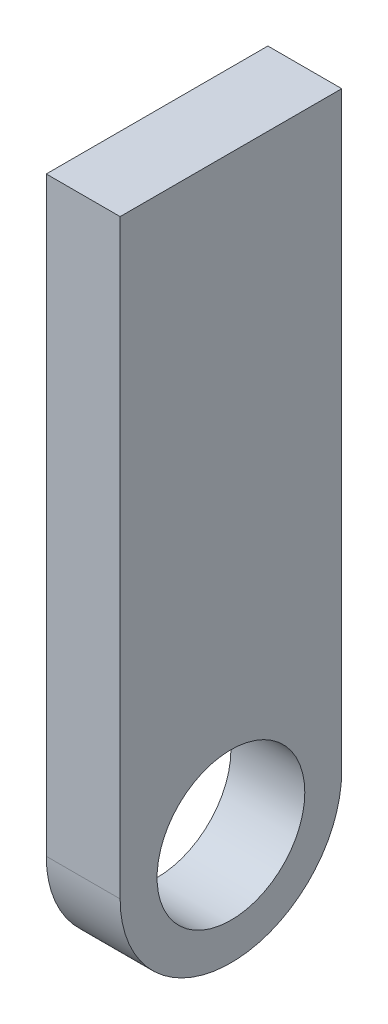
ISO-10303-21;
HEADER;
FILE_DESCRIPTION(('STEP AP214'),'2;1');
FILE_NAME('part.step','',(''),(''),'','','');
FILE_SCHEMA(('AUTOMOTIVE_DESIGN { 1 0 10303 214 1 1 1 1 }'));
ENDSEC;
DATA;
#1=APPLICATION_CONTEXT('core data for automotive mechanical design processes');
#2=APPLICATION_PROTOCOL_DEFINITION('international standard','automotive_design',2000,#1);
#3=PRODUCT_CONTEXT('',#1,'mechanical');
#4=PRODUCT('Part','Part','',(#3));
#5=PRODUCT_RELATED_PRODUCT_CATEGORY('part','',(#4));
#6=PRODUCT_DEFINITION_FORMATION('','',#4);
#7=PRODUCT_DEFINITION_CONTEXT('part definition',#1,'design');
#8=PRODUCT_DEFINITION('design','',#6,#7);
#9=PRODUCT_DEFINITION_SHAPE('','',#8);
#10=(LENGTH_UNIT() NAMED_UNIT(*) SI_UNIT(.MILLI.,.METRE.));
#11=(NAMED_UNIT(*) PLANE_ANGLE_UNIT() SI_UNIT($,.RADIAN.));
#12=(NAMED_UNIT(*) SI_UNIT($,.STERADIAN.) SOLID_ANGLE_UNIT());
#13=UNCERTAINTY_MEASURE_WITH_UNIT(LENGTH_MEASURE(1.E-05),#10,'distance_accuracy_value','');
#14=(GEOMETRIC_REPRESENTATION_CONTEXT(3) GLOBAL_UNCERTAINTY_ASSIGNED_CONTEXT((#13)) GLOBAL_UNIT_ASSIGNED_CONTEXT((#10,
#11,#12)) REPRESENTATION_CONTEXT('',''));
#15=CARTESIAN_POINT('',(0.,0.,0.));
#16=DIRECTION('',(0.,0.,1.));
#17=DIRECTION('',(1.,0.,0.));
#18=AXIS2_PLACEMENT_3D('',#15,#16,#17);
#19=CARTESIAN_POINT('',(10.,0.,0.));
#20=DIRECTION('',(1.,0.,0.));
#21=DIRECTION('',(0.,0.,-1.));
#22=AXIS2_PLACEMENT_3D('',#19,#20,#21);
#23=PLANE('',#22);
#24=DIRECTION('',(0.,0.,1.));
#25=VECTOR('',#24,1.);
#26=CARTESIAN_POINT('',(10.,80.,15.));
#27=LINE('',#26,#25);
#28=CARTESIAN_POINT('',(10.,80.,-15.));
#29=VERTEX_POINT('',#28);
#30=CARTESIAN_POINT('',(10.,80.,15.));
#31=VERTEX_POINT('',#30);
#32=EDGE_CURVE('E87',#29,#31,#27,.T.);
#33=ORIENTED_EDGE('',*,*,#32,.T.);
#34=DIRECTION('',(0.,-1.,0.));
#35=VECTOR('',#34,1.);
#36=CARTESIAN_POINT('',(10.,0.,15.));
#37=LINE('',#36,#35);
#38=CARTESIAN_POINT('',(10.,0.,15.));
#39=VERTEX_POINT('',#38);
#40=EDGE_CURVE('E82',#31,#39,#37,.T.);
#41=ORIENTED_EDGE('',*,*,#40,.T.);
#42=CARTESIAN_POINT('',(10.,0.,0.));
#43=DIRECTION('',(1.,0.,0.));
#44=DIRECTION('',(0.,0.,-1.));
#45=AXIS2_PLACEMENT_3D('',#42,#43,#44);
#46=CIRCLE('',#45,15.);
#47=CARTESIAN_POINT('',(10.,0.,-15.));
#48=VERTEX_POINT('',#47);
#49=EDGE_CURVE('E85',#39,#48,#46,.T.);
#50=ORIENTED_EDGE('',*,*,#49,.T.);
#51=DIRECTION('',(0.,1.,0.));
#52=VECTOR('',#51,1.);
#53=CARTESIAN_POINT('',(10.,80.,-15.));
#54=LINE('',#53,#52);
#55=EDGE_CURVE('E52',#48,#29,#54,.T.);
#56=ORIENTED_EDGE('',*,*,#55,.T.);
#57=EDGE_LOOP('',(#33,#41,#50,#56));
#58=FACE_BOUND('',#57,.T.);
#59=CARTESIAN_POINT('',(10.,0.,0.));
#60=DIRECTION('',(1.,0.,0.));
#61=DIRECTION('',(0.,0.,-1.));
#62=AXIS2_PLACEMENT_3D('',#59,#60,#61);
#63=CIRCLE('',#62,10.);
#64=CARTESIAN_POINT('',(10.,0.,-10.));
#65=VERTEX_POINT('',#64);
#66=EDGE_CURVE('E102',#65,#65,#63,.T.);
#67=ORIENTED_EDGE('',*,*,#66,.F.);
#68=EDGE_LOOP('',(#67));
#69=FACE_BOUND('',#68,.T.);
#70=ADVANCED_FACE('F35',(#58,#69),#23,.T.);
#71=CARTESIAN_POINT('',(0.,0.,0.));
#72=DIRECTION('',(1.,0.,0.));
#73=DIRECTION('',(0.,0.,-1.));
#74=AXIS2_PLACEMENT_3D('',#71,#72,#73);
#75=PLANE('',#74);
#76=DIRECTION('',(0.,0.,1.));
#77=VECTOR('',#76,1.);
#78=CARTESIAN_POINT('',(0.,80.,15.));
#79=LINE('',#78,#77);
#80=CARTESIAN_POINT('',(0.,80.,-15.));
#81=VERTEX_POINT('',#80);
#82=CARTESIAN_POINT('',(0.,80.,15.));
#83=VERTEX_POINT('',#82);
#84=EDGE_CURVE('E99',#81,#83,#79,.T.);
#85=ORIENTED_EDGE('',*,*,#84,.F.);
#86=DIRECTION('',(0.,1.,0.));
#87=VECTOR('',#86,1.);
#88=CARTESIAN_POINT('',(0.,80.,-15.));
#89=LINE('',#88,#87);
#90=CARTESIAN_POINT('',(0.,0.,-15.));
#91=VERTEX_POINT('',#90);
#92=EDGE_CURVE('E75',#91,#81,#89,.T.);
#93=ORIENTED_EDGE('',*,*,#92,.F.);
#94=CARTESIAN_POINT('',(0.,0.,0.));
#95=DIRECTION('',(1.,0.,0.));
#96=DIRECTION('',(0.,0.,-1.));
#97=AXIS2_PLACEMENT_3D('',#94,#95,#96);
#98=CIRCLE('',#97,15.);
#99=CARTESIAN_POINT('',(0.,0.,15.));
#100=VERTEX_POINT('',#99);
#101=EDGE_CURVE('E69',#100,#91,#98,.T.);
#102=ORIENTED_EDGE('',*,*,#101,.F.);
#103=DIRECTION('',(0.,-1.,0.));
#104=VECTOR('',#103,1.);
#105=CARTESIAN_POINT('',(0.,0.,15.));
#106=LINE('',#105,#104);
#107=EDGE_CURVE('E91',#83,#100,#106,.T.);
#108=ORIENTED_EDGE('',*,*,#107,.F.);
#109=EDGE_LOOP('',(#85,#93,#102,#108));
#110=FACE_BOUND('',#109,.T.);
#111=CARTESIAN_POINT('',(0.,0.,0.));
#112=DIRECTION('',(1.,0.,0.));
#113=DIRECTION('',(0.,0.,-1.));
#114=AXIS2_PLACEMENT_3D('',#111,#112,#113);
#115=CIRCLE('',#114,10.);
#116=CARTESIAN_POINT('',(0.,0.,-10.));
#117=VERTEX_POINT('',#116);
#118=EDGE_CURVE('E114',#117,#117,#115,.T.);
#119=ORIENTED_EDGE('',*,*,#118,.T.);
#120=EDGE_LOOP('',(#119));
#121=FACE_BOUND('',#120,.T.);
#122=ADVANCED_FACE('F110',(#110,#121),#75,.F.);
#123=CARTESIAN_POINT('',(10.,80.,15.));
#124=DIRECTION('',(0.,-1.,0.));
#125=DIRECTION('',(0.,0.,-1.));
#126=AXIS2_PLACEMENT_3D('',#123,#124,#125);
#127=PLANE('',#126);
#128=ORIENTED_EDGE('',*,*,#84,.T.);
#129=DIRECTION('',(-1.,0.,0.));
#130=VECTOR('',#129,1.);
#131=CARTESIAN_POINT('',(10.,80.,15.));
#132=LINE('',#131,#130);
#133=EDGE_CURVE('E11',#31,#83,#132,.T.);
#134=ORIENTED_EDGE('',*,*,#133,.F.);
#135=ORIENTED_EDGE('',*,*,#32,.F.);
#136=DIRECTION('',(-1.,0.,0.));
#137=VECTOR('',#136,1.);
#138=CARTESIAN_POINT('',(10.,80.,-15.));
#139=LINE('',#138,#137);
#140=EDGE_CURVE('E95',#29,#81,#139,.T.);
#141=ORIENTED_EDGE('',*,*,#140,.T.);
#142=EDGE_LOOP('',(#128,#134,#135,#141));
#143=FACE_BOUND('',#142,.T.);
#144=ADVANCED_FACE('F37',(#143),#127,.F.);
#145=CARTESIAN_POINT('',(10.,0.,15.));
#146=DIRECTION('',(0.,0.,-1.));
#147=DIRECTION('',(0.,1.,0.));
#148=AXIS2_PLACEMENT_3D('',#145,#146,#147);
#149=PLANE('',#148);
#150=ORIENTED_EDGE('',*,*,#107,.T.);
#151=DIRECTION('',(-1.,0.,0.));
#152=VECTOR('',#151,1.);
#153=CARTESIAN_POINT('',(10.,0.,15.));
#154=LINE('',#153,#152);
#155=EDGE_CURVE('E44',#39,#100,#154,.T.);
#156=ORIENTED_EDGE('',*,*,#155,.F.);
#157=ORIENTED_EDGE('',*,*,#40,.F.);
#158=ORIENTED_EDGE('',*,*,#133,.T.);
#159=EDGE_LOOP('',(#150,#156,#157,#158));
#160=FACE_BOUND('',#159,.T.);
#161=ADVANCED_FACE('F90',(#160),#149,.F.);
#162=CARTESIAN_POINT('',(10.,0.,0.));
#163=DIRECTION('',(-1.,0.,0.));
#164=DIRECTION('',(0.,0.,1.));
#165=AXIS2_PLACEMENT_3D('',#162,#163,#164);
#166=CYLINDRICAL_SURFACE('',#165,15.);
#167=ORIENTED_EDGE('',*,*,#101,.T.);
#168=DIRECTION('',(-1.,0.,0.));
#169=VECTOR('',#168,1.);
#170=CARTESIAN_POINT('',(10.,0.,-15.));
#171=LINE('',#170,#169);
#172=EDGE_CURVE('E92',#48,#91,#171,.T.);
#173=ORIENTED_EDGE('',*,*,#172,.F.);
#174=ORIENTED_EDGE('',*,*,#49,.F.);
#175=ORIENTED_EDGE('',*,*,#155,.T.);
#176=EDGE_LOOP('',(#167,#173,#174,#175));
#177=FACE_BOUND('',#176,.T.);
#178=ADVANCED_FACE('F93',(#177),#166,.T.);
#179=CARTESIAN_POINT('',(10.,80.,-15.));
#180=DIRECTION('',(0.,0.,1.));
#181=DIRECTION('',(0.,-1.,0.));
#182=AXIS2_PLACEMENT_3D('',#179,#180,#181);
#183=PLANE('',#182);
#184=ORIENTED_EDGE('',*,*,#92,.T.);
#185=ORIENTED_EDGE('',*,*,#140,.F.);
#186=ORIENTED_EDGE('',*,*,#55,.F.);
#187=ORIENTED_EDGE('',*,*,#172,.T.);
#188=EDGE_LOOP('',(#184,#185,#186,#187));
#189=FACE_BOUND('',#188,.T.);
#190=ADVANCED_FACE('F107',(#189),#183,.F.);
#191=CARTESIAN_POINT('',(10.,0.,0.));
#192=DIRECTION('',(-1.,0.,0.));
#193=DIRECTION('',(0.,0.,1.));
#194=AXIS2_PLACEMENT_3D('',#191,#192,#193);
#195=CYLINDRICAL_SURFACE('',#194,10.);
#196=ORIENTED_EDGE('',*,*,#66,.T.);
#197=EDGE_LOOP('',(#196));
#198=FACE_BOUND('',#197,.T.);
#199=ORIENTED_EDGE('',*,*,#118,.F.);
#200=EDGE_LOOP('',(#199));
#201=FACE_BOUND('',#200,.T.);
#202=ADVANCED_FACE('F120',(#198,#201),#195,.F.);
#203=CLOSED_SHELL('',(#70,#122,#144,#161,#178,#190,#202));
#204=MANIFOLD_SOLID_BREP('B2',#203);
#205=ADVANCED_BREP_SHAPE_REPRESENTATION('',(#18,#204),#14);
#206=SHAPE_DEFINITION_REPRESENTATION(#9,#205);
ENDSEC;
END-ISO-10303-21;
